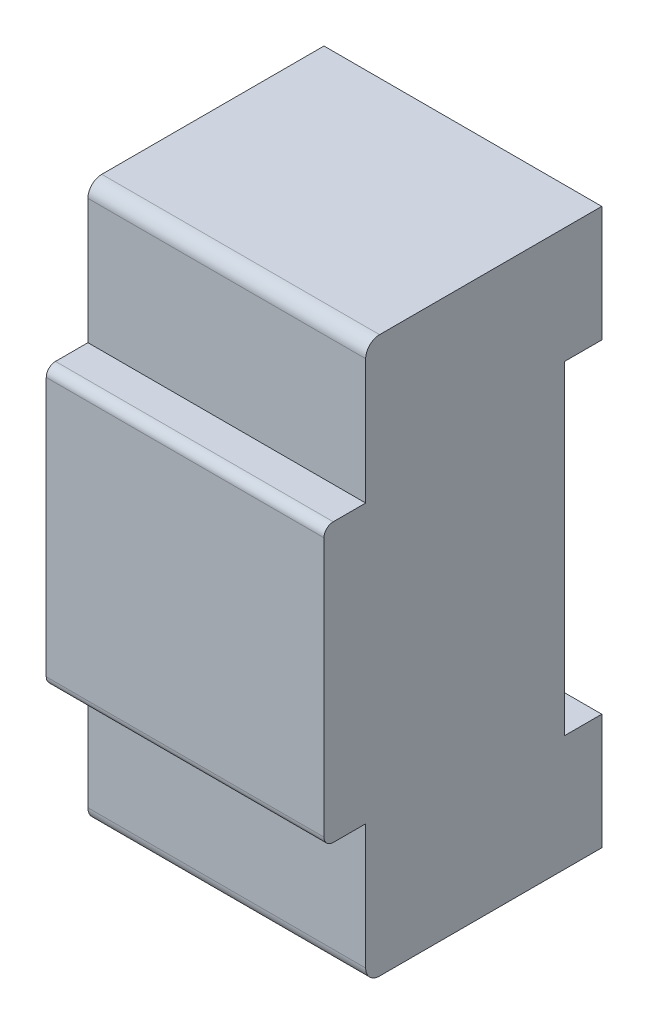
ISO-10303-21;
HEADER;
FILE_DESCRIPTION(('STEP AP214'),'2;1');
FILE_NAME('part.step','',(''),(''),'','','');
FILE_SCHEMA(('AUTOMOTIVE_DESIGN { 1 0 10303 214 1 1 1 1 }'));
ENDSEC;
DATA;
#1=APPLICATION_CONTEXT('core data for automotive mechanical design processes');
#2=APPLICATION_PROTOCOL_DEFINITION('international standard','automotive_design',2000,#1);
#3=PRODUCT_CONTEXT('',#1,'mechanical');
#4=PRODUCT('Part','Part','',(#3));
#5=PRODUCT_RELATED_PRODUCT_CATEGORY('part','',(#4));
#6=PRODUCT_DEFINITION_FORMATION('','',#4);
#7=PRODUCT_DEFINITION_CONTEXT('part definition',#1,'design');
#8=PRODUCT_DEFINITION('design','',#6,#7);
#9=PRODUCT_DEFINITION_SHAPE('','',#8);
#10=(LENGTH_UNIT() NAMED_UNIT(*) SI_UNIT(.MILLI.,.METRE.));
#11=(NAMED_UNIT(*) PLANE_ANGLE_UNIT() SI_UNIT($,.RADIAN.));
#12=(NAMED_UNIT(*) SI_UNIT($,.STERADIAN.) SOLID_ANGLE_UNIT());
#13=UNCERTAINTY_MEASURE_WITH_UNIT(LENGTH_MEASURE(1.E-05),#10,'distance_accuracy_value','');
#14=(GEOMETRIC_REPRESENTATION_CONTEXT(3) GLOBAL_UNCERTAINTY_ASSIGNED_CONTEXT((#13)) GLOBAL_UNIT_ASSIGNED_CONTEXT((#10,
#11,#12)) REPRESENTATION_CONTEXT('',''));
#15=CARTESIAN_POINT('',(0.,0.,0.));
#16=DIRECTION('',(0.,0.,1.));
#17=DIRECTION('',(1.,0.,0.));
#18=AXIS2_PLACEMENT_3D('',#15,#16,#17);
#19=CARTESIAN_POINT('',(30.,-35.,0.));
#20=DIRECTION('',(0.,0.,1.));
#21=DIRECTION('',(1.,0.,0.));
#22=AXIS2_PLACEMENT_3D('',#19,#20,#21);
#23=PLANE('',#22);
#24=DIRECTION('',(0.,1.,0.));
#25=VECTOR('',#24,1.);
#26=CARTESIAN_POINT('',(0.,-35.,0.));
#27=LINE('',#26,#25);
#28=CARTESIAN_POINT('',(0.,-35.,0.));
#29=VERTEX_POINT('',#28);
#30=CARTESIAN_POINT('',(0.,0.,0.));
#31=VERTEX_POINT('',#30);
#32=EDGE_CURVE('E169',#29,#31,#27,.T.);
#33=ORIENTED_EDGE('',*,*,#32,.T.);
#34=DIRECTION('',(-1.,0.,0.));
#35=VECTOR('',#34,1.);
#36=CARTESIAN_POINT('',(30.,0.,0.));
#37=LINE('',#36,#35);
#38=CARTESIAN_POINT('',(30.,0.,0.));
#39=VERTEX_POINT('',#38);
#40=EDGE_CURVE('E150',#39,#31,#37,.T.);
#41=ORIENTED_EDGE('',*,*,#40,.F.);
#42=DIRECTION('',(0.,1.,0.));
#43=VECTOR('',#42,1.);
#44=CARTESIAN_POINT('',(30.,-35.,0.));
#45=LINE('',#44,#43);
#46=CARTESIAN_POINT('',(30.,-35.,0.));
#47=VERTEX_POINT('',#46);
#48=EDGE_CURVE('E157',#47,#39,#45,.T.);
#49=ORIENTED_EDGE('',*,*,#48,.F.);
#50=DIRECTION('',(-1.,0.,0.));
#51=VECTOR('',#50,1.);
#52=CARTESIAN_POINT('',(30.,-35.,0.));
#53=LINE('',#52,#51);
#54=EDGE_CURVE('E245',#47,#29,#53,.T.);
#55=ORIENTED_EDGE('',*,*,#54,.T.);
#56=EDGE_LOOP('',(#33,#41,#49,#55));
#57=FACE_BOUND('',#56,.T.);
#58=ADVANCED_FACE('F31',(#57),#23,.F.);
#59=CARTESIAN_POINT('',(30.,0.,0.));
#60=DIRECTION('',(0.,1.,0.));
#61=DIRECTION('',(0.,0.,1.));
#62=AXIS2_PLACEMENT_3D('',#59,#60,#61);
#63=PLANE('',#62);
#64=DIRECTION('',(0.,0.,-1.));
#65=VECTOR('',#64,1.);
#66=CARTESIAN_POINT('',(0.,0.,0.));
#67=LINE('',#66,#65);
#68=CARTESIAN_POINT('',(0.,0.,-4.));
#69=VERTEX_POINT('',#68);
#70=EDGE_CURVE('E272',#31,#69,#67,.T.);
#71=ORIENTED_EDGE('',*,*,#70,.T.);
#72=DIRECTION('',(-1.,0.,0.));
#73=VECTOR('',#72,1.);
#74=CARTESIAN_POINT('',(30.,0.,-4.));
#75=LINE('',#74,#73);
#76=CARTESIAN_POINT('',(30.,0.,-4.));
#77=VERTEX_POINT('',#76);
#78=EDGE_CURVE('E153',#77,#69,#75,.T.);
#79=ORIENTED_EDGE('',*,*,#78,.F.);
#80=DIRECTION('',(0.,0.,-1.));
#81=VECTOR('',#80,1.);
#82=CARTESIAN_POINT('',(30.,0.,0.));
#83=LINE('',#82,#81);
#84=EDGE_CURVE('E146',#39,#77,#83,.T.);
#85=ORIENTED_EDGE('',*,*,#84,.F.);
#86=ORIENTED_EDGE('',*,*,#40,.T.);
#87=EDGE_LOOP('',(#71,#79,#85,#86));
#88=FACE_BOUND('',#87,.T.);
#89=ADVANCED_FACE('F148',(#88),#63,.F.);
#90=CARTESIAN_POINT('',(30.,0.,-4.));
#91=DIRECTION('',(0.,0.,1.));
#92=DIRECTION('',(1.,0.,0.));
#93=AXIS2_PLACEMENT_3D('',#90,#91,#92);
#94=PLANE('',#93);
#95=DIRECTION('',(0.,1.,0.));
#96=VECTOR('',#95,1.);
#97=CARTESIAN_POINT('',(0.,0.,-4.));
#98=LINE('',#97,#96);
#99=CARTESIAN_POINT('',(0.,12.5,-4.));
#100=VERTEX_POINT('',#99);
#101=EDGE_CURVE('E269',#69,#100,#98,.T.);
#102=ORIENTED_EDGE('',*,*,#101,.T.);
#103=DIRECTION('',(-1.,0.,0.));
#104=VECTOR('',#103,1.);
#105=CARTESIAN_POINT('',(30.,12.5,-4.));
#106=LINE('',#105,#104);
#107=CARTESIAN_POINT('',(30.,12.5,-4.));
#108=VERTEX_POINT('',#107);
#109=EDGE_CURVE('E175',#108,#100,#106,.T.);
#110=ORIENTED_EDGE('',*,*,#109,.F.);
#111=DIRECTION('',(0.,1.,0.));
#112=VECTOR('',#111,1.);
#113=CARTESIAN_POINT('',(30.,0.,-4.));
#114=LINE('',#113,#112);
#115=EDGE_CURVE('E156',#77,#108,#114,.T.);
#116=ORIENTED_EDGE('',*,*,#115,.F.);
#117=ORIENTED_EDGE('',*,*,#78,.T.);
#118=EDGE_LOOP('',(#102,#110,#116,#117));
#119=FACE_BOUND('',#118,.T.);
#120=ADVANCED_FACE('F290',(#119),#94,.F.);
#121=CARTESIAN_POINT('',(30.,12.5,-4.));
#122=DIRECTION('',(0.,-1.,0.));
#123=DIRECTION('',(0.,0.,-1.));
#124=AXIS2_PLACEMENT_3D('',#121,#122,#123);
#125=PLANE('',#124);
#126=DIRECTION('',(0.,0.,1.));
#127=VECTOR('',#126,1.);
#128=CARTESIAN_POINT('',(0.,12.5,-4.));
#129=LINE('',#128,#127);
#130=CARTESIAN_POINT('',(0.,12.5,20.));
#131=VERTEX_POINT('',#130);
#132=EDGE_CURVE('E263',#100,#131,#129,.T.);
#133=ORIENTED_EDGE('',*,*,#132,.T.);
#134=DIRECTION('',(-1.,0.,0.));
#135=VECTOR('',#134,1.);
#136=CARTESIAN_POINT('',(30.,12.5,20.));
#137=LINE('',#136,#135);
#138=CARTESIAN_POINT('',(30.,12.5,20.));
#139=VERTEX_POINT('',#138);
#140=EDGE_CURVE('E191',#131,#139,#137,.F.);
#141=ORIENTED_EDGE('',*,*,#140,.T.);
#142=DIRECTION('',(0.,0.,1.));
#143=VECTOR('',#142,1.);
#144=CARTESIAN_POINT('',(30.,12.5,-4.));
#145=LINE('',#144,#143);
#146=EDGE_CURVE('E266',#108,#139,#145,.T.);
#147=ORIENTED_EDGE('',*,*,#146,.F.);
#148=ORIENTED_EDGE('',*,*,#109,.T.);
#149=EDGE_LOOP('',(#133,#141,#147,#148));
#150=FACE_BOUND('',#149,.T.);
#151=ADVANCED_FACE('F262',(#150),#125,.F.);
#152=CARTESIAN_POINT('',(30.,12.5,21.5));
#153=DIRECTION('',(0.,0.,-1.));
#154=DIRECTION('',(-1.,0.,0.));
#155=AXIS2_PLACEMENT_3D('',#152,#153,#154);
#156=PLANE('',#155);
#157=DIRECTION('',(0.,-1.,0.));
#158=VECTOR('',#157,1.);
#159=CARTESIAN_POINT('',(30.,12.5,21.5));
#160=LINE('',#159,#158);
#161=CARTESIAN_POINT('',(30.,11.,21.5));
#162=VERTEX_POINT('',#161);
#163=CARTESIAN_POINT('',(30.,-2.50000000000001,21.5));
#164=VERTEX_POINT('',#163);
#165=EDGE_CURVE('E286',#162,#164,#160,.T.);
#166=ORIENTED_EDGE('',*,*,#165,.F.);
#167=DIRECTION('',(-1.,0.,0.));
#168=VECTOR('',#167,1.);
#169=CARTESIAN_POINT('',(30.,11.,21.5));
#170=LINE('',#169,#168);
#171=CARTESIAN_POINT('',(0.,11.,21.5));
#172=VERTEX_POINT('',#171);
#173=EDGE_CURVE('E188',#162,#172,#170,.T.);
#174=ORIENTED_EDGE('',*,*,#173,.T.);
#175=DIRECTION('',(0.,-1.,0.));
#176=VECTOR('',#175,1.);
#177=CARTESIAN_POINT('',(0.,12.5,21.5));
#178=LINE('',#177,#176);
#179=CARTESIAN_POINT('',(0.,-2.50000000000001,21.5));
#180=VERTEX_POINT('',#179);
#181=EDGE_CURVE('E234',#172,#180,#178,.T.);
#182=ORIENTED_EDGE('',*,*,#181,.T.);
#183=DIRECTION('',(-1.,0.,0.));
#184=VECTOR('',#183,1.);
#185=CARTESIAN_POINT('',(30.,-2.50000000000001,21.5));
#186=LINE('',#185,#184);
#187=EDGE_CURVE('E254',#164,#180,#186,.T.);
#188=ORIENTED_EDGE('',*,*,#187,.F.);
#189=EDGE_LOOP('',(#166,#174,#182,#188));
#190=FACE_BOUND('',#189,.T.);
#191=ADVANCED_FACE('F297',(#190),#156,.F.);
#192=CARTESIAN_POINT('',(30.,-2.50000000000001,21.5));
#193=DIRECTION('',(0.,-1.,0.));
#194=DIRECTION('',(0.,0.,-1.));
#195=AXIS2_PLACEMENT_3D('',#192,#193,#194);
#196=PLANE('',#195);
#197=DIRECTION('',(0.,0.,1.));
#198=VECTOR('',#197,1.);
#199=CARTESIAN_POINT('',(0.,-2.50000000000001,21.5));
#200=LINE('',#199,#198);
#201=CARTESIAN_POINT('',(0.,-2.5,25.));
#202=VERTEX_POINT('',#201);
#203=EDGE_CURVE('E230',#180,#202,#200,.T.);
#204=ORIENTED_EDGE('',*,*,#203,.T.);
#205=DIRECTION('',(-1.,0.,0.));
#206=VECTOR('',#205,1.);
#207=CARTESIAN_POINT('',(30.,-2.5,25.));
#208=LINE('',#207,#206);
#209=CARTESIAN_POINT('',(30.,-2.5,25.));
#210=VERTEX_POINT('',#209);
#211=EDGE_CURVE('E11',#202,#210,#208,.F.);
#212=ORIENTED_EDGE('',*,*,#211,.T.);
#213=DIRECTION('',(0.,0.,1.));
#214=VECTOR('',#213,1.);
#215=CARTESIAN_POINT('',(30.,-2.50000000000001,21.5));
#216=LINE('',#215,#214);
#217=EDGE_CURVE('E284',#164,#210,#216,.T.);
#218=ORIENTED_EDGE('',*,*,#217,.F.);
#219=ORIENTED_EDGE('',*,*,#187,.T.);
#220=EDGE_LOOP('',(#204,#212,#218,#219));
#221=FACE_BOUND('',#220,.T.);
#222=ADVANCED_FACE('F322',(#221),#196,.F.);
#223=CARTESIAN_POINT('',(30.,-2.5,26.));
#224=DIRECTION('',(0.,0.,-1.));
#225=DIRECTION('',(-1.,0.,0.));
#226=AXIS2_PLACEMENT_3D('',#223,#224,#225);
#227=PLANE('',#226);
#228=DIRECTION('',(0.,-1.,0.));
#229=VECTOR('',#228,1.);
#230=CARTESIAN_POINT('',(0.,-2.5,26.));
#231=LINE('',#230,#229);
#232=CARTESIAN_POINT('',(0.,-3.5,26.));
#233=VERTEX_POINT('',#232);
#234=CARTESIAN_POINT('',(0.,-31.5,26.));
#235=VERTEX_POINT('',#234);
#236=EDGE_CURVE('E225',#233,#235,#231,.T.);
#237=ORIENTED_EDGE('',*,*,#236,.T.);
#238=DIRECTION('',(-1.,0.,0.));
#239=VECTOR('',#238,1.);
#240=CARTESIAN_POINT('',(30.,-31.5,26.));
#241=LINE('',#240,#239);
#242=CARTESIAN_POINT('',(30.,-31.5,26.));
#243=VERTEX_POINT('',#242);
#244=EDGE_CURVE('E52',#235,#243,#241,.F.);
#245=ORIENTED_EDGE('',*,*,#244,.T.);
#246=DIRECTION('',(0.,-1.,0.));
#247=VECTOR('',#246,1.);
#248=CARTESIAN_POINT('',(30.,-2.5,26.));
#249=LINE('',#248,#247);
#250=CARTESIAN_POINT('',(30.,-3.5,26.));
#251=VERTEX_POINT('',#250);
#252=EDGE_CURVE('E210',#251,#243,#249,.T.);
#253=ORIENTED_EDGE('',*,*,#252,.F.);
#254=DIRECTION('',(-1.,0.,0.));
#255=VECTOR('',#254,1.);
#256=CARTESIAN_POINT('',(30.,-3.5,26.));
#257=LINE('',#256,#255);
#258=EDGE_CURVE('E200',#251,#233,#257,.T.);
#259=ORIENTED_EDGE('',*,*,#258,.T.);
#260=EDGE_LOOP('',(#237,#245,#253,#259));
#261=FACE_BOUND('',#260,.T.);
#262=ADVANCED_FACE('F228',(#261),#227,.F.);
#263=CARTESIAN_POINT('',(30.,-32.5,26.));
#264=DIRECTION('',(0.,1.,0.));
#265=DIRECTION('',(0.,0.,1.));
#266=AXIS2_PLACEMENT_3D('',#263,#264,#265);
#267=PLANE('',#266);
#268=DIRECTION('',(0.,0.,-1.));
#269=VECTOR('',#268,1.);
#270=CARTESIAN_POINT('',(30.,-32.5,26.));
#271=LINE('',#270,#269);
#272=CARTESIAN_POINT('',(30.,-32.5,25.));
#273=VERTEX_POINT('',#272);
#274=CARTESIAN_POINT('',(30.,-32.5,21.5));
#275=VERTEX_POINT('',#274);
#276=EDGE_CURVE('E208',#273,#275,#271,.T.);
#277=ORIENTED_EDGE('',*,*,#276,.F.);
#278=DIRECTION('',(-1.,0.,0.));
#279=VECTOR('',#278,1.);
#280=CARTESIAN_POINT('',(30.,-32.5,25.));
#281=LINE('',#280,#279);
#282=CARTESIAN_POINT('',(0.,-32.5,25.));
#283=VERTEX_POINT('',#282);
#284=EDGE_CURVE('E193',#273,#283,#281,.T.);
#285=ORIENTED_EDGE('',*,*,#284,.T.);
#286=DIRECTION('',(0.,0.,-1.));
#287=VECTOR('',#286,1.);
#288=CARTESIAN_POINT('',(0.,-32.5,26.));
#289=LINE('',#288,#287);
#290=CARTESIAN_POINT('',(0.,-32.5,21.5));
#291=VERTEX_POINT('',#290);
#292=EDGE_CURVE('E227',#283,#291,#289,.T.);
#293=ORIENTED_EDGE('',*,*,#292,.T.);
#294=DIRECTION('',(-1.,0.,0.));
#295=VECTOR('',#294,1.);
#296=CARTESIAN_POINT('',(30.,-32.5,21.5));
#297=LINE('',#296,#295);
#298=EDGE_CURVE('E217',#275,#291,#297,.T.);
#299=ORIENTED_EDGE('',*,*,#298,.F.);
#300=EDGE_LOOP('',(#277,#285,#293,#299));
#301=FACE_BOUND('',#300,.T.);
#302=ADVANCED_FACE('F214',(#301),#267,.F.);
#303=CARTESIAN_POINT('',(30.,-32.5,21.5));
#304=DIRECTION('',(0.,0.,-1.));
#305=DIRECTION('',(-1.,0.,0.));
#306=AXIS2_PLACEMENT_3D('',#303,#304,#305);
#307=PLANE('',#306);
#308=DIRECTION('',(0.,-1.,0.));
#309=VECTOR('',#308,1.);
#310=CARTESIAN_POINT('',(0.,-32.5,21.5));
#311=LINE('',#310,#309);
#312=CARTESIAN_POINT('',(0.,-46.,21.5));
#313=VERTEX_POINT('',#312);
#314=EDGE_CURVE('E232',#291,#313,#311,.T.);
#315=ORIENTED_EDGE('',*,*,#314,.T.);
#316=DIRECTION('',(-1.,0.,0.));
#317=VECTOR('',#316,1.);
#318=CARTESIAN_POINT('',(30.,-46.,21.5));
#319=LINE('',#318,#317);
#320=CARTESIAN_POINT('',(30.,-46.,21.5));
#321=VERTEX_POINT('',#320);
#322=EDGE_CURVE('E182',#313,#321,#319,.F.);
#323=ORIENTED_EDGE('',*,*,#322,.T.);
#324=DIRECTION('',(0.,-1.,0.));
#325=VECTOR('',#324,1.);
#326=CARTESIAN_POINT('',(30.,-32.5,21.5));
#327=LINE('',#326,#325);
#328=EDGE_CURVE('E219',#275,#321,#327,.T.);
#329=ORIENTED_EDGE('',*,*,#328,.F.);
#330=ORIENTED_EDGE('',*,*,#298,.T.);
#331=EDGE_LOOP('',(#315,#323,#329,#330));
#332=FACE_BOUND('',#331,.T.);
#333=ADVANCED_FACE('F337',(#332),#307,.F.);
#334=CARTESIAN_POINT('',(30.,-47.5,21.5));
#335=DIRECTION('',(0.,1.,0.));
#336=DIRECTION('',(0.,0.,1.));
#337=AXIS2_PLACEMENT_3D('',#334,#335,#336);
#338=PLANE('',#337);
#339=DIRECTION('',(0.,0.,-1.));
#340=VECTOR('',#339,1.);
#341=CARTESIAN_POINT('',(30.,-47.5,21.5));
#342=LINE('',#341,#340);
#343=CARTESIAN_POINT('',(30.,-47.5,20.));
#344=VERTEX_POINT('',#343);
#345=CARTESIAN_POINT('',(30.,-47.5,-4.));
#346=VERTEX_POINT('',#345);
#347=EDGE_CURVE('E280',#344,#346,#342,.T.);
#348=ORIENTED_EDGE('',*,*,#347,.F.);
#349=DIRECTION('',(-1.,0.,0.));
#350=VECTOR('',#349,1.);
#351=CARTESIAN_POINT('',(30.,-47.5,20.));
#352=LINE('',#351,#350);
#353=CARTESIAN_POINT('',(0.,-47.5,20.));
#354=VERTEX_POINT('',#353);
#355=EDGE_CURVE('E170',#344,#354,#352,.T.);
#356=ORIENTED_EDGE('',*,*,#355,.T.);
#357=DIRECTION('',(0.,0.,-1.));
#358=VECTOR('',#357,1.);
#359=CARTESIAN_POINT('',(0.,-47.5,21.5));
#360=LINE('',#359,#358);
#361=CARTESIAN_POINT('',(0.,-47.5,-4.));
#362=VERTEX_POINT('',#361);
#363=EDGE_CURVE('E240',#354,#362,#360,.T.);
#364=ORIENTED_EDGE('',*,*,#363,.T.);
#365=DIRECTION('',(-1.,0.,0.));
#366=VECTOR('',#365,1.);
#367=CARTESIAN_POINT('',(30.,-47.5,-4.));
#368=LINE('',#367,#366);
#369=EDGE_CURVE('E250',#346,#362,#368,.T.);
#370=ORIENTED_EDGE('',*,*,#369,.F.);
#371=EDGE_LOOP('',(#348,#356,#364,#370));
#372=FACE_BOUND('',#371,.T.);
#373=ADVANCED_FACE('F340',(#372),#338,.F.);
#374=CARTESIAN_POINT('',(30.,-47.5,-4.));
#375=DIRECTION('',(0.,0.,1.));
#376=DIRECTION('',(1.,0.,0.));
#377=AXIS2_PLACEMENT_3D('',#374,#375,#376);
#378=PLANE('',#377);
#379=DIRECTION('',(0.,1.,0.));
#380=VECTOR('',#379,1.);
#381=CARTESIAN_POINT('',(0.,-47.5,-4.));
#382=LINE('',#381,#380);
#383=CARTESIAN_POINT('',(0.,-35.,-4.));
#384=VERTEX_POINT('',#383);
#385=EDGE_CURVE('E242',#362,#384,#382,.T.);
#386=ORIENTED_EDGE('',*,*,#385,.T.);
#387=DIRECTION('',(-1.,0.,0.));
#388=VECTOR('',#387,1.);
#389=CARTESIAN_POINT('',(30.,-35.,-4.));
#390=LINE('',#389,#388);
#391=CARTESIAN_POINT('',(30.,-35.,-4.));
#392=VERTEX_POINT('',#391);
#393=EDGE_CURVE('E247',#392,#384,#390,.T.);
#394=ORIENTED_EDGE('',*,*,#393,.F.);
#395=DIRECTION('',(0.,1.,0.));
#396=VECTOR('',#395,1.);
#397=CARTESIAN_POINT('',(30.,-47.5,-4.));
#398=LINE('',#397,#396);
#399=EDGE_CURVE('E278',#346,#392,#398,.T.);
#400=ORIENTED_EDGE('',*,*,#399,.F.);
#401=ORIENTED_EDGE('',*,*,#369,.T.);
#402=EDGE_LOOP('',(#386,#394,#400,#401));
#403=FACE_BOUND('',#402,.T.);
#404=ADVANCED_FACE('F344',(#403),#378,.F.);
#405=CARTESIAN_POINT('',(30.,-35.,-4.));
#406=DIRECTION('',(0.,-1.,0.));
#407=DIRECTION('',(0.,0.,-1.));
#408=AXIS2_PLACEMENT_3D('',#405,#406,#407);
#409=PLANE('',#408);
#410=DIRECTION('',(0.,0.,1.));
#411=VECTOR('',#410,1.);
#412=CARTESIAN_POINT('',(0.,-35.,-4.));
#413=LINE('',#412,#411);
#414=EDGE_CURVE('E166',#384,#29,#413,.T.);
#415=ORIENTED_EDGE('',*,*,#414,.T.);
#416=ORIENTED_EDGE('',*,*,#54,.F.);
#417=DIRECTION('',(0.,0.,1.));
#418=VECTOR('',#417,1.);
#419=CARTESIAN_POINT('',(30.,-35.,-4.));
#420=LINE('',#419,#418);
#421=EDGE_CURVE('E162',#392,#47,#420,.T.);
#422=ORIENTED_EDGE('',*,*,#421,.F.);
#423=ORIENTED_EDGE('',*,*,#393,.T.);
#424=EDGE_LOOP('',(#415,#416,#422,#423));
#425=FACE_BOUND('',#424,.T.);
#426=ADVANCED_FACE('F348',(#425),#409,.F.);
#427=CARTESIAN_POINT('',(30.,0.,0.));
#428=DIRECTION('',(-1.,0.,0.));
#429=DIRECTION('',(0.,0.,1.));
#430=AXIS2_PLACEMENT_3D('',#427,#428,#429);
#431=PLANE('',#430);
#432=ORIENTED_EDGE('',*,*,#252,.T.);
#433=CARTESIAN_POINT('',(30.,-31.5,25.));
#434=DIRECTION('',(-1.,0.,0.));
#435=DIRECTION('',(0.,0.,1.));
#436=AXIS2_PLACEMENT_3D('',#433,#434,#435);
#437=CIRCLE('',#436,1.);
#438=EDGE_CURVE('E39',#243,#273,#437,.F.);
#439=ORIENTED_EDGE('',*,*,#438,.T.);
#440=ORIENTED_EDGE('',*,*,#276,.T.);
#441=ORIENTED_EDGE('',*,*,#328,.T.);
#442=CARTESIAN_POINT('',(30.,-46.,20.));
#443=DIRECTION('',(-1.,0.,0.));
#444=DIRECTION('',(0.,0.,1.));
#445=AXIS2_PLACEMENT_3D('',#442,#443,#444);
#446=CIRCLE('',#445,1.5);
#447=EDGE_CURVE('E186',#321,#344,#446,.F.);
#448=ORIENTED_EDGE('',*,*,#447,.T.);
#449=ORIENTED_EDGE('',*,*,#347,.T.);
#450=ORIENTED_EDGE('',*,*,#399,.T.);
#451=ORIENTED_EDGE('',*,*,#421,.T.);
#452=ORIENTED_EDGE('',*,*,#48,.T.);
#453=ORIENTED_EDGE('',*,*,#84,.T.);
#454=ORIENTED_EDGE('',*,*,#115,.T.);
#455=ORIENTED_EDGE('',*,*,#146,.T.);
#456=CARTESIAN_POINT('',(30.,11.,20.));
#457=DIRECTION('',(-1.,0.,0.));
#458=DIRECTION('',(0.,0.,1.));
#459=AXIS2_PLACEMENT_3D('',#456,#457,#458);
#460=CIRCLE('',#459,1.5);
#461=EDGE_CURVE('E184',#139,#162,#460,.F.);
#462=ORIENTED_EDGE('',*,*,#461,.T.);
#463=ORIENTED_EDGE('',*,*,#165,.T.);
#464=ORIENTED_EDGE('',*,*,#217,.T.);
#465=CARTESIAN_POINT('',(30.,-3.5,25.));
#466=DIRECTION('',(-1.,0.,0.));
#467=DIRECTION('',(0.,0.,1.));
#468=AXIS2_PLACEMENT_3D('',#465,#466,#467);
#469=CIRCLE('',#468,1.);
#470=EDGE_CURVE('E204',#210,#251,#469,.F.);
#471=ORIENTED_EDGE('',*,*,#470,.T.);
#472=EDGE_LOOP('',(#432,#439,#440,#441,#448,#449,#450,#451,#452,#453,#454,#455,#462,#463,#464,#471));
#473=FACE_BOUND('',#472,.T.);
#474=ADVANCED_FACE('F160',(#473),#431,.F.);
#475=CARTESIAN_POINT('',(0.,0.,0.));
#476=DIRECTION('',(-1.,0.,0.));
#477=DIRECTION('',(0.,0.,1.));
#478=AXIS2_PLACEMENT_3D('',#475,#476,#477);
#479=PLANE('',#478);
#480=ORIENTED_EDGE('',*,*,#292,.F.);
#481=CARTESIAN_POINT('',(0.,-31.5,25.));
#482=DIRECTION('',(-1.,0.,0.));
#483=DIRECTION('',(0.,0.,1.));
#484=AXIS2_PLACEMENT_3D('',#481,#482,#483);
#485=CIRCLE('',#484,1.);
#486=EDGE_CURVE('E198',#283,#235,#485,.T.);
#487=ORIENTED_EDGE('',*,*,#486,.T.);
#488=ORIENTED_EDGE('',*,*,#236,.F.);
#489=CARTESIAN_POINT('',(0.,-3.5,25.));
#490=DIRECTION('',(-1.,0.,0.));
#491=DIRECTION('',(0.,0.,1.));
#492=AXIS2_PLACEMENT_3D('',#489,#490,#491);
#493=CIRCLE('',#492,1.);
#494=EDGE_CURVE('E196',#233,#202,#493,.T.);
#495=ORIENTED_EDGE('',*,*,#494,.T.);
#496=ORIENTED_EDGE('',*,*,#203,.F.);
#497=ORIENTED_EDGE('',*,*,#181,.F.);
#498=CARTESIAN_POINT('',(0.,11.,20.));
#499=DIRECTION('',(-1.,0.,0.));
#500=DIRECTION('',(0.,0.,1.));
#501=AXIS2_PLACEMENT_3D('',#498,#499,#500);
#502=CIRCLE('',#501,1.5);
#503=EDGE_CURVE('E173',#172,#131,#502,.T.);
#504=ORIENTED_EDGE('',*,*,#503,.T.);
#505=ORIENTED_EDGE('',*,*,#132,.F.);
#506=ORIENTED_EDGE('',*,*,#101,.F.);
#507=ORIENTED_EDGE('',*,*,#70,.F.);
#508=ORIENTED_EDGE('',*,*,#32,.F.);
#509=ORIENTED_EDGE('',*,*,#414,.F.);
#510=ORIENTED_EDGE('',*,*,#385,.F.);
#511=ORIENTED_EDGE('',*,*,#363,.F.);
#512=CARTESIAN_POINT('',(0.,-46.,20.));
#513=DIRECTION('',(-1.,0.,0.));
#514=DIRECTION('',(0.,0.,1.));
#515=AXIS2_PLACEMENT_3D('',#512,#513,#514);
#516=CIRCLE('',#515,1.5);
#517=EDGE_CURVE('E180',#354,#313,#516,.T.);
#518=ORIENTED_EDGE('',*,*,#517,.T.);
#519=ORIENTED_EDGE('',*,*,#314,.F.);
#520=EDGE_LOOP('',(#480,#487,#488,#495,#496,#497,#504,#505,#506,#507,#508,#509,#510,#511,#518,#519));
#521=FACE_BOUND('',#520,.T.);
#522=ADVANCED_FACE('F224',(#521),#479,.T.);
#523=CARTESIAN_POINT('',(30.,-46.,20.));
#524=DIRECTION('',(-1.,0.,0.));
#525=DIRECTION('',(0.,0.,1.));
#526=AXIS2_PLACEMENT_3D('',#523,#524,#525);
#527=CYLINDRICAL_SURFACE('',#526,1.5);
#528=ORIENTED_EDGE('',*,*,#447,.F.);
#529=ORIENTED_EDGE('',*,*,#322,.F.);
#530=ORIENTED_EDGE('',*,*,#517,.F.);
#531=ORIENTED_EDGE('',*,*,#355,.F.);
#532=EDGE_LOOP('',(#528,#529,#530,#531));
#533=FACE_BOUND('',#532,.T.);
#534=ADVANCED_FACE('F305',(#533),#527,.T.);
#535=CARTESIAN_POINT('',(30.,11.,20.));
#536=DIRECTION('',(-1.,0.,0.));
#537=DIRECTION('',(0.,0.,1.));
#538=AXIS2_PLACEMENT_3D('',#535,#536,#537);
#539=CYLINDRICAL_SURFACE('',#538,1.5);
#540=ORIENTED_EDGE('',*,*,#461,.F.);
#541=ORIENTED_EDGE('',*,*,#140,.F.);
#542=ORIENTED_EDGE('',*,*,#503,.F.);
#543=ORIENTED_EDGE('',*,*,#173,.F.);
#544=EDGE_LOOP('',(#540,#541,#542,#543));
#545=FACE_BOUND('',#544,.T.);
#546=ADVANCED_FACE('F308',(#545),#539,.T.);
#547=CARTESIAN_POINT('',(30.,-31.5,25.));
#548=DIRECTION('',(-1.,0.,0.));
#549=DIRECTION('',(0.,0.,1.));
#550=AXIS2_PLACEMENT_3D('',#547,#548,#549);
#551=CYLINDRICAL_SURFACE('',#550,1.);
#552=ORIENTED_EDGE('',*,*,#438,.F.);
#553=ORIENTED_EDGE('',*,*,#244,.F.);
#554=ORIENTED_EDGE('',*,*,#486,.F.);
#555=ORIENTED_EDGE('',*,*,#284,.F.);
#556=EDGE_LOOP('',(#552,#553,#554,#555));
#557=FACE_BOUND('',#556,.T.);
#558=ADVANCED_FACE('F221',(#557),#551,.T.);
#559=CARTESIAN_POINT('',(30.,-3.5,25.));
#560=DIRECTION('',(-1.,0.,0.));
#561=DIRECTION('',(0.,0.,1.));
#562=AXIS2_PLACEMENT_3D('',#559,#560,#561);
#563=CYLINDRICAL_SURFACE('',#562,1.);
#564=ORIENTED_EDGE('',*,*,#470,.F.);
#565=ORIENTED_EDGE('',*,*,#211,.F.);
#566=ORIENTED_EDGE('',*,*,#494,.F.);
#567=ORIENTED_EDGE('',*,*,#258,.F.);
#568=EDGE_LOOP('',(#564,#565,#566,#567));
#569=FACE_BOUND('',#568,.T.);
#570=ADVANCED_FACE('F33',(#569),#563,.T.);
#571=CLOSED_SHELL('',(#58,#89,#120,#151,#191,#222,#262,#302,#333,#373,#404,#426,#474,#522,#534,
#546,#558,#570));
#572=MANIFOLD_SOLID_BREP('B2',#571);
#573=ADVANCED_BREP_SHAPE_REPRESENTATION('',(#18,#572),#14);
#574=SHAPE_DEFINITION_REPRESENTATION(#9,#573);
ENDSEC;
END-ISO-10303-21;
